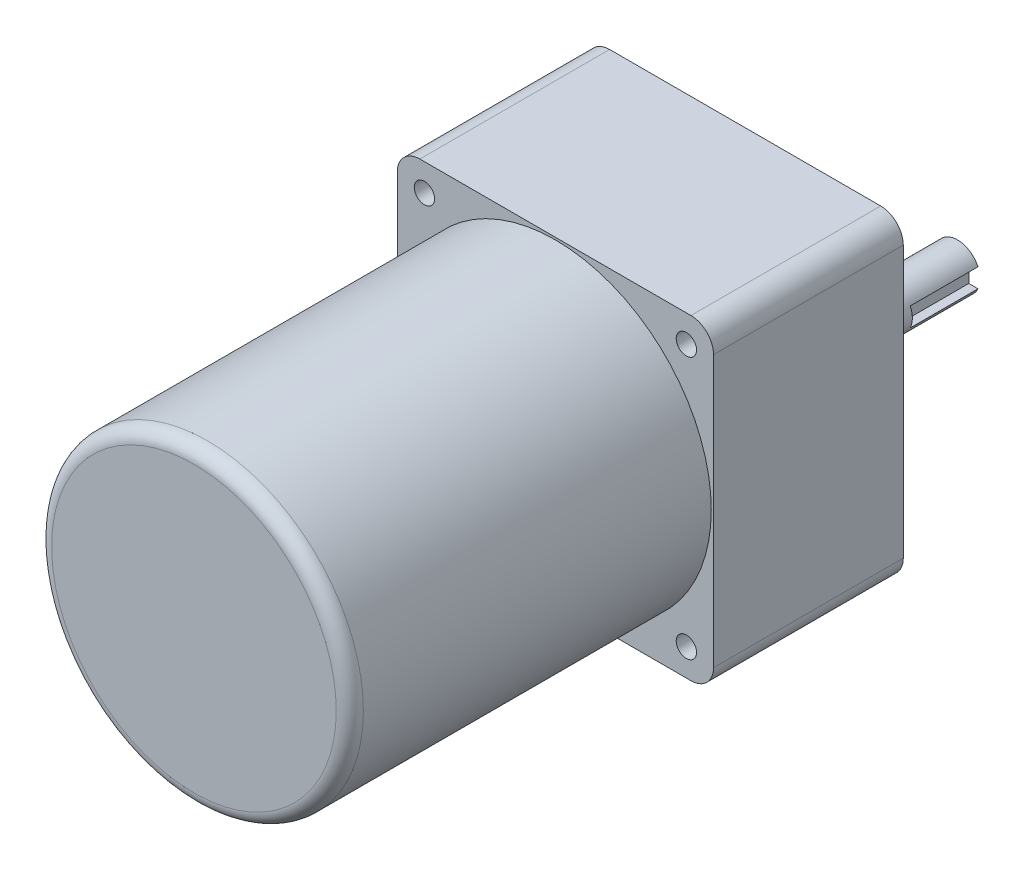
from build123d import *

# Parameters (mm, degrees)
SKETCH_1_R          = 2.25
EXTRUDE_1_DEPTH     = 42
SKETCH_2_R          = 34.5
EXTRUDE_2_DEPTH     = 80
FILLET_1_R          = 3
SKETCH_3_R          = 15
EXTRUDE_3_DEPTH     = 3
SKETCH_4_R          = 5
EXTRUDE_4_DEPTH     = 29
FILLET_2_R          = 0.5
CUT_EXTRUDE_START   = -15
CUT_EXTRUDE_1_DEPTH = 15


with BuildPart() as part:
    # Sketch 1 → Extrude 1 (new body)
    with BuildSketch(Plane.XY):
        with BuildLine():
            Line((-35, -30), (-35, 30))
            ThreePointArc((-35, 30), (-33.535533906, 33.535533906), (-30, 35))
            Line((-30, 35), (30, 35))
            ThreePointArc((30, 35), (33.535533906, 33.535533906), (35, 30))
            Line((35, 30), (35, -30))
            ThreePointArc((35, -30), (33.535533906, -33.535533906), (30, -35))
            Line((30, -35), (-30, -35))
            ThreePointArc((-30, -35), (-33.535533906, -33.535533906), (-35, -30))
        make_face()
        with Locations(Location((28.991378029, 28.991378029, 0), (0, 0, 180))):
            Circle(SKETCH_1_R, mode=Mode.SUBTRACT)
        with Locations(Location((-28.991378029, 28.991378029, 0), (0, 0, 180))):
            Circle(SKETCH_1_R, mode=Mode.SUBTRACT)
        with Locations(Location((-28.991378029, -28.991378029, 0), (0, 0, 180))):
            Circle(SKETCH_1_R, mode=Mode.SUBTRACT)
        with Locations(Location((28.991378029, -28.991378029, 0), (0, 0, 180))):
            Circle(SKETCH_1_R, mode=Mode.SUBTRACT)
    extrude(amount=EXTRUDE_1_DEPTH)

    # Sketch 2 → Extrude 2 (add)
    with BuildSketch(Plane.XY.offset(42)):
        Circle(SKETCH_2_R)
    extrude(amount=EXTRUDE_2_DEPTH)

    # Fillet 1
    fillet_1_edges = [part.edges().sort_by_distance(p)[0] for p in [
        (-34.5, 0, 122),
    ]]
    fillet(fillet_1_edges, radius=FILLET_1_R)

    # Sketch 3 → Extrude 3 (add)
    with BuildSketch(Plane(origin=(0, 0, 0), x_dir=(-1, 0, 0), z_dir=(0, 0, -1))):
        with Locations(Location((-15, 0, 0), (0, 0, 180))):
            Circle(SKETCH_3_R)
    extrude(amount=EXTRUDE_3_DEPTH)

    # Sketch 4 → Extrude 4 (add)
    with BuildSketch(Plane(origin=(0, 0, -3), x_dir=(-1, 0, 0), z_dir=(0, 0, -1))):
        with Locations(Location((-15, 0, 0), (0, 0, 180))):
            Circle(SKETCH_4_R)
    extrude(amount=EXTRUDE_4_DEPTH)

    # Fillet 2
    fillet_2_edges = [part.edges().sort_by_distance(p)[0] for p in [
        (0, 0, -3),
    ]]
    fillet(fillet_2_edges, radius=FILLET_2_R)

    # Sketch 5 → Cut-Extrude 1 (cut)
    with BuildSketch(Plane(origin=(0, 0, -32), x_dir=(-1, 0, 0), z_dir=(0, 0, -1)).offset(CUT_EXTRUDE_START)):
        with BuildLine():
            Line((-17.5, -2.104743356), (-17.5, 2.104743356))
            Line((-17.5, 2.104743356), (-19.535422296, 2.104743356))
            ThreePointArc((-19.535422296, 2.104743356), (-20, 0), (-19.535422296, -2.104743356))
            Line((-19.535422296, -2.104743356), (-17.5, -2.104743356))
        make_face()
    extrude(amount=CUT_EXTRUDE_1_DEPTH, mode=Mode.SUBTRACT)


solid = part.part
